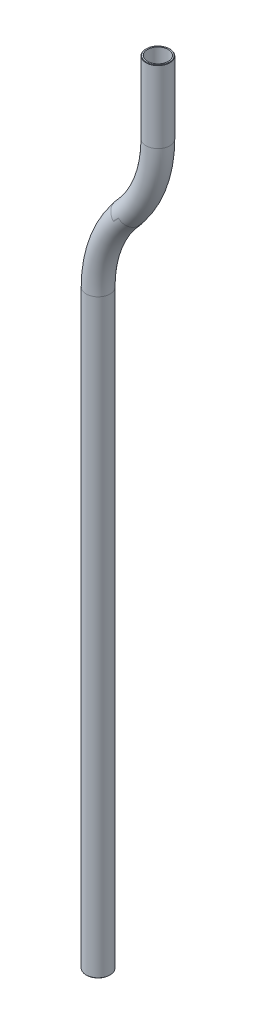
ISO-10303-21;
HEADER;
FILE_DESCRIPTION(('STEP AP214'),'2;1');
FILE_NAME('part.step','',(''),(''),'','','');
FILE_SCHEMA(('AUTOMOTIVE_DESIGN { 1 0 10303 214 1 1 1 1 }'));
ENDSEC;
DATA;
#1=APPLICATION_CONTEXT('core data for automotive mechanical design processes');
#2=APPLICATION_PROTOCOL_DEFINITION('international standard','automotive_design',2000,#1);
#3=PRODUCT_CONTEXT('',#1,'mechanical');
#4=PRODUCT('Part','Part','',(#3));
#5=PRODUCT_RELATED_PRODUCT_CATEGORY('part','',(#4));
#6=PRODUCT_DEFINITION_FORMATION('','',#4);
#7=PRODUCT_DEFINITION_CONTEXT('part definition',#1,'design');
#8=PRODUCT_DEFINITION('design','',#6,#7);
#9=PRODUCT_DEFINITION_SHAPE('','',#8);
#10=(LENGTH_UNIT() NAMED_UNIT(*) SI_UNIT(.MILLI.,.METRE.));
#11=(NAMED_UNIT(*) PLANE_ANGLE_UNIT() SI_UNIT($,.RADIAN.));
#12=(NAMED_UNIT(*) SI_UNIT($,.STERADIAN.) SOLID_ANGLE_UNIT());
#13=UNCERTAINTY_MEASURE_WITH_UNIT(LENGTH_MEASURE(1.E-05),#10,'distance_accuracy_value','');
#14=(GEOMETRIC_REPRESENTATION_CONTEXT(3) GLOBAL_UNCERTAINTY_ASSIGNED_CONTEXT((#13)) GLOBAL_UNIT_ASSIGNED_CONTEXT((#10,
#11,#12)) REPRESENTATION_CONTEXT('',''));
#15=CARTESIAN_POINT('',(0.,0.,0.));
#16=DIRECTION('',(0.,0.,1.));
#17=DIRECTION('',(1.,0.,0.));
#18=AXIS2_PLACEMENT_3D('',#15,#16,#17);
#19=CARTESIAN_POINT('',(75.0000000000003,939.317121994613,0.));
#20=DIRECTION('',(0.,1.,0.));
#21=DIRECTION('',(-1.,0.,0.));
#22=AXIS2_PLACEMENT_3D('',#19,#20,#21);
#23=CYLINDRICAL_SURFACE('',#22,15.);
#24=CARTESIAN_POINT('',(75.0000000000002,1029.5,0.));
#25=DIRECTION('',(0.,1.,0.));
#26=DIRECTION('',(0.,0.,1.));
#27=AXIS2_PLACEMENT_3D('',#24,#25,#26);
#28=CIRCLE('',#27,15.);
#29=CARTESIAN_POINT('',(75.0000000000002,1029.5,15.));
#30=VERTEX_POINT('',#29);
#31=EDGE_CURVE('E10',#30,#30,#28,.F.);
#32=ORIENTED_EDGE('',*,*,#31,.T.);
#33=EDGE_LOOP('',(#32));
#34=FACE_BOUND('',#33,.T.);
#35=CARTESIAN_POINT('',(75.0000000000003,939.317121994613,0.));
#36=DIRECTION('',(0.,1.,0.));
#37=DIRECTION('',(0.,0.,1.));
#38=AXIS2_PLACEMENT_3D('',#35,#36,#37);
#39=CIRCLE('',#38,15.);
#40=CARTESIAN_POINT('',(90.0000000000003,939.317121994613,0.));
#41=VERTEX_POINT('',#40);
#42=EDGE_CURVE('E54',#41,#41,#39,.T.);
#43=ORIENTED_EDGE('',*,*,#42,.T.);
#44=EDGE_LOOP('',(#43));
#45=FACE_BOUND('',#44,.T.);
#46=ADVANCED_FACE('F31',(#34,#45),#23,.T.);
#47=CARTESIAN_POINT('',(75.0000000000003,939.317121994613,0.));
#48=DIRECTION('',(0.,1.,0.));
#49=DIRECTION('',(-1.,0.,0.));
#50=AXIS2_PLACEMENT_3D('',#47,#48,#49);
#51=CYLINDRICAL_SURFACE('',#50,13.);
#52=CARTESIAN_POINT('',(75.0000000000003,939.317121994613,0.));
#53=DIRECTION('',(0.,1.,0.));
#54=DIRECTION('',(0.,0.,1.));
#55=AXIS2_PLACEMENT_3D('',#52,#53,#54);
#56=CIRCLE('',#55,13.);
#57=CARTESIAN_POINT('',(88.0000000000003,939.317121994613,0.));
#58=VERTEX_POINT('',#57);
#59=EDGE_CURVE('E57',#58,#58,#56,.T.);
#60=ORIENTED_EDGE('',*,*,#59,.F.);
#61=EDGE_LOOP('',(#60));
#62=FACE_BOUND('',#61,.T.);
#63=CARTESIAN_POINT('',(75.0000000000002,1030.,0.));
#64=DIRECTION('',(0.,1.,0.));
#65=DIRECTION('',(0.,0.,1.));
#66=AXIS2_PLACEMENT_3D('',#63,#64,#65);
#67=CIRCLE('',#66,13.);
#68=CARTESIAN_POINT('',(75.0000000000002,1030.,13.));
#69=VERTEX_POINT('',#68);
#70=EDGE_CURVE('E51',#69,#69,#67,.T.);
#71=ORIENTED_EDGE('',*,*,#70,.T.);
#72=EDGE_LOOP('',(#71));
#73=FACE_BOUND('',#72,.T.);
#74=ADVANCED_FACE('F106',(#62,#73),#51,.F.);
#75=CARTESIAN_POINT('',(-75.,939.317121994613,0.));
#76=DIRECTION('',(0.,0.,1.));
#77=DIRECTION('',(1.,0.,0.));
#78=AXIS2_PLACEMENT_3D('',#75,#76,#77);
#79=TOROIDAL_SURFACE('',#78,150.,15.);
#80=CARTESIAN_POINT('',(34.430580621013,836.725952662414,0.));
#81=DIRECTION('',(0.68394112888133,0.729537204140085,0.));
#82=DIRECTION('',(0.,0.,1.));
#83=AXIS2_PLACEMENT_3D('',#80,#81,#82);
#84=CIRCLE('',#83,15.);
#85=CARTESIAN_POINT('',(45.3736386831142,826.466835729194,0.));
#86=VERTEX_POINT('',#85);
#87=EDGE_CURVE('E60',#86,#86,#84,.T.);
#88=CARTESIAN_POINT('',(-75.,939.317121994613,0.));
#89=DIRECTION('',(0.,0.,1.));
#90=DIRECTION('',(1.,0.,0.));
#91=AXIS2_PLACEMENT_3D('',#88,#89,#90);
#92=CIRCLE('',#91,165.);
#93=EDGE_CURVE('',#86,#41,#92,.T.);
#94=ORIENTED_EDGE('',*,*,#87,.T.);
#95=ORIENTED_EDGE('',*,*,#42,.F.);
#96=ORIENTED_EDGE('',*,*,#93,.T.);
#97=ORIENTED_EDGE('',*,*,#93,.F.);
#98=EDGE_LOOP('',(#94,#96,#95,#97));
#99=FACE_BOUND('',#98,.T.);
#100=ADVANCED_FACE('F102',(#99),#79,.T.);
#101=CARTESIAN_POINT('',(-75.,939.317121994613,0.));
#102=DIRECTION('',(0.,0.,1.));
#103=DIRECTION('',(1.,0.,0.));
#104=AXIS2_PLACEMENT_3D('',#101,#102,#103);
#105=TOROIDAL_SURFACE('',#104,150.,13.);
#106=CARTESIAN_POINT('',(34.430580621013,836.725952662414,0.));
#107=DIRECTION('',(0.68394112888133,0.729537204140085,0.));
#108=DIRECTION('',(0.,0.,1.));
#109=AXIS2_PLACEMENT_3D('',#106,#107,#108);
#110=CIRCLE('',#109,13.);
#111=CARTESIAN_POINT('',(43.9145642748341,827.834717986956,0.));
#112=VERTEX_POINT('',#111);
#113=EDGE_CURVE('E63',#112,#112,#110,.T.);
#114=CARTESIAN_POINT('',(-75.,939.317121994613,0.));
#115=DIRECTION('',(0.,0.,1.));
#116=DIRECTION('',(1.,0.,0.));
#117=AXIS2_PLACEMENT_3D('',#114,#115,#116);
#118=CIRCLE('',#117,163.);
#119=EDGE_CURVE('',#112,#58,#118,.T.);
#120=ORIENTED_EDGE('',*,*,#113,.F.);
#121=ORIENTED_EDGE('',*,*,#59,.T.);
#122=ORIENTED_EDGE('',*,*,#119,.T.);
#123=ORIENTED_EDGE('',*,*,#119,.F.);
#124=EDGE_LOOP('',(#120,#122,#121,#123));
#125=FACE_BOUND('',#124,.T.);
#126=ADVANCED_FACE('F99',(#125),#105,.F.);
#127=CARTESIAN_POINT('',(40.5694193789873,843.274047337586,0.));
#128=DIRECTION('',(-0.683941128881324,-0.72953720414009,0.));
#129=DIRECTION('',(0.72953720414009,-0.683941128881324,0.));
#130=AXIS2_PLACEMENT_3D('',#127,#128,#129);
#131=CYLINDRICAL_SURFACE('',#130,15.);
#132=CARTESIAN_POINT('',(40.5694193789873,843.274047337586,0.));
#133=DIRECTION('',(0.68394112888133,0.729537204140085,0.));
#134=DIRECTION('',(0.,0.,1.));
#135=AXIS2_PLACEMENT_3D('',#132,#133,#134);
#136=CIRCLE('',#135,15.);
#137=CARTESIAN_POINT('',(29.626361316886,853.533164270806,0.));
#138=VERTEX_POINT('',#137);
#139=EDGE_CURVE('E66',#138,#138,#136,.T.);
#140=ORIENTED_EDGE('',*,*,#139,.T.);
#141=EDGE_LOOP('',(#140));
#142=FACE_BOUND('',#141,.T.);
#143=ORIENTED_EDGE('',*,*,#87,.F.);
#144=EDGE_LOOP('',(#143));
#145=FACE_BOUND('',#144,.T.);
#146=ADVANCED_FACE('F95',(#142,#145),#131,.F.);
#147=CARTESIAN_POINT('',(40.5694193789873,843.274047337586,0.));
#148=DIRECTION('',(-0.683941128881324,-0.72953720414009,0.));
#149=DIRECTION('',(0.72953720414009,-0.683941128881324,0.));
#150=AXIS2_PLACEMENT_3D('',#147,#148,#149);
#151=CYLINDRICAL_SURFACE('',#150,13.);
#152=CARTESIAN_POINT('',(40.5694193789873,843.274047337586,0.));
#153=DIRECTION('',(0.68394112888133,0.729537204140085,0.));
#154=DIRECTION('',(0.,0.,1.));
#155=AXIS2_PLACEMENT_3D('',#152,#153,#154);
#156=CIRCLE('',#155,13.);
#157=CARTESIAN_POINT('',(31.0854357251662,852.165282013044,0.));
#158=VERTEX_POINT('',#157);
#159=EDGE_CURVE('E69',#158,#158,#156,.T.);
#160=ORIENTED_EDGE('',*,*,#159,.F.);
#161=EDGE_LOOP('',(#160));
#162=FACE_BOUND('',#161,.T.);
#163=ORIENTED_EDGE('',*,*,#113,.T.);
#164=EDGE_LOOP('',(#163));
#165=FACE_BOUND('',#164,.T.);
#166=ADVANCED_FACE('F92',(#162,#165),#151,.T.);
#167=CARTESIAN_POINT('',(150.,740.682878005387,0.));
#168=DIRECTION('',(0.,0.,-1.));
#169=DIRECTION('',(-1.,0.,0.));
#170=AXIS2_PLACEMENT_3D('',#167,#168,#169);
#171=TOROIDAL_SURFACE('',#170,150.,15.);
#172=CARTESIAN_POINT('',(0.,740.682878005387,0.));
#173=DIRECTION('',(0.,1.,0.));
#174=DIRECTION('',(0.,0.,1.));
#175=AXIS2_PLACEMENT_3D('',#172,#173,#174);
#176=CIRCLE('',#175,15.);
#177=CARTESIAN_POINT('',(-15.,740.682878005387,0.));
#178=VERTEX_POINT('',#177);
#179=EDGE_CURVE('E72',#178,#178,#176,.T.);
#180=CARTESIAN_POINT('',(150.,740.682878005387,0.));
#181=DIRECTION('',(0.,0.,-1.));
#182=DIRECTION('',(-1.,0.,0.));
#183=AXIS2_PLACEMENT_3D('',#180,#181,#182);
#184=CIRCLE('',#183,165.);
#185=EDGE_CURVE('',#178,#138,#184,.T.);
#186=ORIENTED_EDGE('',*,*,#179,.T.);
#187=ORIENTED_EDGE('',*,*,#139,.F.);
#188=ORIENTED_EDGE('',*,*,#185,.T.);
#189=ORIENTED_EDGE('',*,*,#185,.F.);
#190=EDGE_LOOP('',(#186,#188,#187,#189));
#191=FACE_BOUND('',#190,.T.);
#192=ADVANCED_FACE('F88',(#191),#171,.T.);
#193=CARTESIAN_POINT('',(150.,740.682878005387,0.));
#194=DIRECTION('',(0.,0.,-1.));
#195=DIRECTION('',(-1.,0.,0.));
#196=AXIS2_PLACEMENT_3D('',#193,#194,#195);
#197=TOROIDAL_SURFACE('',#196,150.,13.);
#198=CARTESIAN_POINT('',(0.,740.682878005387,0.));
#199=DIRECTION('',(0.,1.,0.));
#200=DIRECTION('',(0.,0.,1.));
#201=AXIS2_PLACEMENT_3D('',#198,#199,#200);
#202=CIRCLE('',#201,13.);
#203=CARTESIAN_POINT('',(-13.,740.682878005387,0.));
#204=VERTEX_POINT('',#203);
#205=EDGE_CURVE('E76',#204,#204,#202,.T.);
#206=CARTESIAN_POINT('',(150.,740.682878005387,0.));
#207=DIRECTION('',(0.,0.,-1.));
#208=DIRECTION('',(-1.,0.,0.));
#209=AXIS2_PLACEMENT_3D('',#206,#207,#208);
#210=CIRCLE('',#209,163.);
#211=EDGE_CURVE('',#204,#158,#210,.T.);
#212=ORIENTED_EDGE('',*,*,#205,.F.);
#213=ORIENTED_EDGE('',*,*,#159,.T.);
#214=ORIENTED_EDGE('',*,*,#211,.T.);
#215=ORIENTED_EDGE('',*,*,#211,.F.);
#216=EDGE_LOOP('',(#212,#214,#213,#215));
#217=FACE_BOUND('',#216,.T.);
#218=ADVANCED_FACE('F85',(#217),#197,.F.);
#219=CARTESIAN_POINT('',(0.,740.682878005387,0.));
#220=DIRECTION('',(0.,-1.,0.));
#221=DIRECTION('',(0.,0.,-1.));
#222=AXIS2_PLACEMENT_3D('',#219,#220,#221);
#223=CYLINDRICAL_SURFACE('',#222,13.);
#224=ORIENTED_EDGE('',*,*,#205,.T.);
#225=EDGE_LOOP('',(#224));
#226=FACE_BOUND('',#225,.T.);
#227=CARTESIAN_POINT('',(0.,0.,0.));
#228=DIRECTION('',(0.,1.,0.));
#229=DIRECTION('',(0.,0.,1.));
#230=AXIS2_PLACEMENT_3D('',#227,#228,#229);
#231=CIRCLE('',#230,13.);
#232=CARTESIAN_POINT('',(0.,0.,13.));
#233=VERTEX_POINT('',#232);
#234=EDGE_CURVE('E73',#233,#233,#231,.T.);
#235=ORIENTED_EDGE('',*,*,#234,.F.);
#236=EDGE_LOOP('',(#235));
#237=FACE_BOUND('',#236,.T.);
#238=ADVANCED_FACE('F82',(#226,#237),#223,.F.);
#239=CARTESIAN_POINT('',(0.,740.682878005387,0.));
#240=DIRECTION('',(0.,-1.,0.));
#241=DIRECTION('',(0.,0.,-1.));
#242=AXIS2_PLACEMENT_3D('',#239,#240,#241);
#243=CYLINDRICAL_SURFACE('',#242,15.);
#244=CARTESIAN_POINT('',(0.,0.499999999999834,0.));
#245=DIRECTION('',(0.,1.,0.));
#246=DIRECTION('',(0.,0.,1.));
#247=AXIS2_PLACEMENT_3D('',#244,#245,#246);
#248=CIRCLE('',#247,15.);
#249=CARTESIAN_POINT('',(0.,0.499999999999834,15.));
#250=VERTEX_POINT('',#249);
#251=EDGE_CURVE('E46',#250,#250,#248,.T.);
#252=ORIENTED_EDGE('',*,*,#251,.T.);
#253=EDGE_LOOP('',(#252));
#254=FACE_BOUND('',#253,.T.);
#255=ORIENTED_EDGE('',*,*,#179,.F.);
#256=EDGE_LOOP('',(#255));
#257=FACE_BOUND('',#256,.T.);
#258=ADVANCED_FACE('F115',(#254,#257),#243,.T.);
#259=CARTESIAN_POINT('',(75.0000000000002,1030.,0.));
#260=DIRECTION('',(0.,1.,0.));
#261=DIRECTION('',(0.,0.,1.));
#262=AXIS2_PLACEMENT_3D('',#259,#260,#261);
#263=PLANE('',#262);
#264=CARTESIAN_POINT('',(75.0000000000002,1030.,0.));
#265=DIRECTION('',(0.,1.,0.));
#266=DIRECTION('',(-1.,0.,0.));
#267=AXIS2_PLACEMENT_3D('',#264,#265,#266);
#268=CIRCLE('',#267,14.5000000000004);
#269=CARTESIAN_POINT('',(60.4999999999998,1030.,0.));
#270=VERTEX_POINT('',#269);
#271=EDGE_CURVE('E38',#270,#270,#268,.T.);
#272=ORIENTED_EDGE('',*,*,#271,.T.);
#273=EDGE_LOOP('',(#272));
#274=FACE_BOUND('',#273,.T.);
#275=ORIENTED_EDGE('',*,*,#70,.F.);
#276=EDGE_LOOP('',(#275));
#277=FACE_BOUND('',#276,.T.);
#278=ADVANCED_FACE('F112',(#274,#277),#263,.T.);
#279=CARTESIAN_POINT('',(0.,0.,0.));
#280=DIRECTION('',(0.,1.,0.));
#281=DIRECTION('',(0.,0.,1.));
#282=AXIS2_PLACEMENT_3D('',#279,#280,#281);
#283=PLANE('',#282);
#284=CARTESIAN_POINT('',(0.,0.,0.));
#285=DIRECTION('',(0.,1.,0.));
#286=DIRECTION('',(0.,0.,1.));
#287=AXIS2_PLACEMENT_3D('',#284,#285,#286);
#288=CIRCLE('',#287,14.5000000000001);
#289=CARTESIAN_POINT('',(0.,0.,14.5000000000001));
#290=VERTEX_POINT('',#289);
#291=EDGE_CURVE('E42',#290,#290,#288,.F.);
#292=ORIENTED_EDGE('',*,*,#291,.T.);
#293=EDGE_LOOP('',(#292));
#294=FACE_BOUND('',#293,.T.);
#295=ORIENTED_EDGE('',*,*,#234,.T.);
#296=EDGE_LOOP('',(#295));
#297=FACE_BOUND('',#296,.T.);
#298=ADVANCED_FACE('F114',(#294,#297),#283,.F.);
#299=CARTESIAN_POINT('',(0.,0.499999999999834,0.));
#300=DIRECTION('',(0.,1.,0.));
#301=DIRECTION('',(0.,0.,1.));
#302=AXIS2_PLACEMENT_3D('',#299,#300,#301);
#303=CONICAL_SURFACE('',#302,15.,0.785398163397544);
#304=ORIENTED_EDGE('',*,*,#291,.F.);
#305=EDGE_LOOP('',(#304));
#306=FACE_BOUND('',#305,.T.);
#307=ORIENTED_EDGE('',*,*,#251,.F.);
#308=EDGE_LOOP('',(#307));
#309=FACE_BOUND('',#308,.T.);
#310=ADVANCED_FACE('F121',(#306,#309),#303,.T.);
#311=CARTESIAN_POINT('',(75.0000000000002,1030.,0.));
#312=DIRECTION('',(0.,-1.,0.));
#313=DIRECTION('',(0.,0.,-1.));
#314=AXIS2_PLACEMENT_3D('',#311,#312,#313);
#315=CONICAL_SURFACE('',#314,14.5000000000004,0.785398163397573);
#316=ORIENTED_EDGE('',*,*,#31,.F.);
#317=EDGE_LOOP('',(#316));
#318=FACE_BOUND('',#317,.T.);
#319=ORIENTED_EDGE('',*,*,#271,.F.);
#320=EDGE_LOOP('',(#319));
#321=FACE_BOUND('',#320,.T.);
#322=ADVANCED_FACE('F33',(#318,#321),#315,.T.);
#323=CLOSED_SHELL('',(#46,#74,#100,#126,#146,#166,#192,#218,#238,#258,#278,#298,#310,#322));
#324=MANIFOLD_SOLID_BREP('B2',#323);
#325=ADVANCED_BREP_SHAPE_REPRESENTATION('',(#18,#324),#14);
#326=SHAPE_DEFINITION_REPRESENTATION(#9,#325);
ENDSEC;
END-ISO-10303-21;
